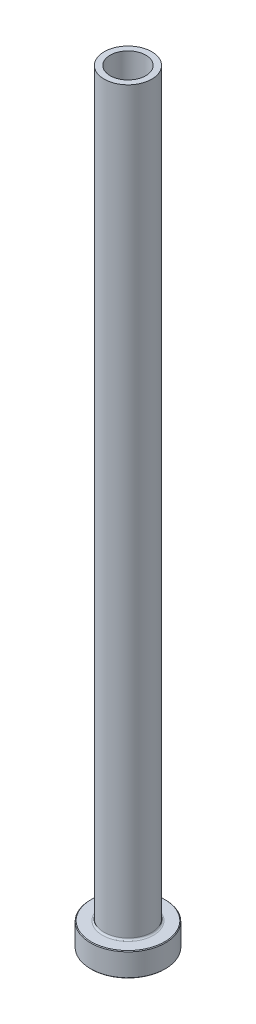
ISO-10303-21;
HEADER;
FILE_DESCRIPTION(('STEP AP214'),'2;1');
FILE_NAME('part.step','',(''),(''),'','','');
FILE_SCHEMA(('AUTOMOTIVE_DESIGN { 1 0 10303 214 1 1 1 1 }'));
ENDSEC;
DATA;
#1=APPLICATION_CONTEXT('core data for automotive mechanical design processes');
#2=APPLICATION_PROTOCOL_DEFINITION('international standard','automotive_design',2000,#1);
#3=PRODUCT_CONTEXT('',#1,'mechanical');
#4=PRODUCT('Part','Part','',(#3));
#5=PRODUCT_RELATED_PRODUCT_CATEGORY('part','',(#4));
#6=PRODUCT_DEFINITION_FORMATION('','',#4);
#7=PRODUCT_DEFINITION_CONTEXT('part definition',#1,'design');
#8=PRODUCT_DEFINITION('design','',#6,#7);
#9=PRODUCT_DEFINITION_SHAPE('','',#8);
#10=(LENGTH_UNIT() NAMED_UNIT(*) SI_UNIT(.MILLI.,.METRE.));
#11=(NAMED_UNIT(*) PLANE_ANGLE_UNIT() SI_UNIT($,.RADIAN.));
#12=(NAMED_UNIT(*) SI_UNIT($,.STERADIAN.) SOLID_ANGLE_UNIT());
#13=UNCERTAINTY_MEASURE_WITH_UNIT(LENGTH_MEASURE(1.E-05),#10,'distance_accuracy_value','');
#14=(GEOMETRIC_REPRESENTATION_CONTEXT(3) GLOBAL_UNCERTAINTY_ASSIGNED_CONTEXT((#13)) GLOBAL_UNIT_ASSIGNED_CONTEXT((#10,
#11,#12)) REPRESENTATION_CONTEXT('',''));
#15=CARTESIAN_POINT('',(0.,0.,0.));
#16=DIRECTION('',(0.,0.,1.));
#17=DIRECTION('',(1.,0.,0.));
#18=AXIS2_PLACEMENT_3D('',#15,#16,#17);
#19=CARTESIAN_POINT('',(0.,92.1876809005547,0.));
#20=DIRECTION('',(0.,1.,0.));
#21=DIRECTION('',(0.,0.,1.));
#22=AXIS2_PLACEMENT_3D('',#19,#20,#21);
#23=CYLINDRICAL_SURFACE('',#22,5.25000000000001);
#24=CARTESIAN_POINT('',(0.,225.,0.));
#25=DIRECTION('',(0.,1.,0.));
#26=DIRECTION('',(0.,0.,1.));
#27=AXIS2_PLACEMENT_3D('',#24,#25,#26);
#28=CIRCLE('',#27,5.25000000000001);
#29=CARTESIAN_POINT('',(0.,225.,5.25000000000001));
#30=VERTEX_POINT('',#29);
#31=EDGE_CURVE('E62',#30,#30,#28,.T.);
#32=ORIENTED_EDGE('',*,*,#31,.T.);
#33=EDGE_LOOP('',(#32));
#34=FACE_BOUND('',#33,.T.);
#35=CARTESIAN_POINT('',(0.,170.,0.));
#36=DIRECTION('',(0.,1.,0.));
#37=DIRECTION('',(0.,0.,1.));
#38=AXIS2_PLACEMENT_3D('',#35,#36,#37);
#39=CIRCLE('',#38,5.25000000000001);
#40=CARTESIAN_POINT('',(0.,170.,5.25000000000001));
#41=VERTEX_POINT('',#40);
#42=EDGE_CURVE('E71',#41,#41,#39,.T.);
#43=ORIENTED_EDGE('',*,*,#42,.F.);
#44=EDGE_LOOP('',(#43));
#45=FACE_BOUND('',#44,.T.);
#46=ADVANCED_FACE('F30',(#34,#45),#23,.F.);
#47=CARTESIAN_POINT('',(-5.25000000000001,225.,0.));
#48=DIRECTION('',(0.,1.,0.));
#49=DIRECTION('',(0.,0.,1.));
#50=AXIS2_PLACEMENT_3D('',#47,#48,#49);
#51=PLANE('',#50);
#52=CARTESIAN_POINT('',(0.,225.,0.));
#53=DIRECTION('',(0.,1.,0.));
#54=DIRECTION('',(0.,0.,1.));
#55=AXIS2_PLACEMENT_3D('',#52,#53,#54);
#56=CIRCLE('',#55,7.00000000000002);
#57=CARTESIAN_POINT('',(0.,225.,7.00000000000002));
#58=VERTEX_POINT('',#57);
#59=EDGE_CURVE('E65',#58,#58,#56,.T.);
#60=ORIENTED_EDGE('',*,*,#59,.T.);
#61=EDGE_LOOP('',(#60));
#62=FACE_BOUND('',#61,.T.);
#63=ORIENTED_EDGE('',*,*,#31,.F.);
#64=EDGE_LOOP('',(#63));
#65=FACE_BOUND('',#64,.T.);
#66=ADVANCED_FACE('F79',(#62,#65),#51,.T.);
#67=CARTESIAN_POINT('',(0.,92.1876809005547,0.));
#68=DIRECTION('',(0.,1.,0.));
#69=DIRECTION('',(0.,0.,1.));
#70=AXIS2_PLACEMENT_3D('',#67,#68,#69);
#71=CYLINDRICAL_SURFACE('',#70,7.);
#72=CARTESIAN_POINT('',(0.,7.50000000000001,0.));
#73=DIRECTION('',(0.,1.,0.));
#74=DIRECTION('',(0.,0.,1.));
#75=AXIS2_PLACEMENT_3D('',#72,#73,#74);
#76=CIRCLE('',#75,7.);
#77=CARTESIAN_POINT('',(0.,7.50000000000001,7.));
#78=VERTEX_POINT('',#77);
#79=EDGE_CURVE('E59',#78,#78,#76,.T.);
#80=ORIENTED_EDGE('',*,*,#79,.T.);
#81=EDGE_LOOP('',(#80));
#82=FACE_BOUND('',#81,.T.);
#83=ORIENTED_EDGE('',*,*,#59,.F.);
#84=EDGE_LOOP('',(#83));
#85=FACE_BOUND('',#84,.T.);
#86=ADVANCED_FACE('F85',(#82,#85),#71,.T.);
#87=CARTESIAN_POINT('',(-6.99999999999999,7.,0.));
#88=DIRECTION('',(0.,1.,0.));
#89=DIRECTION('',(0.,0.,1.));
#90=AXIS2_PLACEMENT_3D('',#87,#88,#89);
#91=PLANE('',#90);
#92=CARTESIAN_POINT('',(0.,7.,0.));
#93=DIRECTION('',(0.,1.,0.));
#94=DIRECTION('',(0.,0.,1.));
#95=AXIS2_PLACEMENT_3D('',#92,#93,#94);
#96=CIRCLE('',#95,10.8);
#97=CARTESIAN_POINT('',(0.,7.,10.8));
#98=VERTEX_POINT('',#97);
#99=EDGE_CURVE('E53',#98,#98,#96,.T.);
#100=ORIENTED_EDGE('',*,*,#99,.T.);
#101=EDGE_LOOP('',(#100));
#102=FACE_BOUND('',#101,.T.);
#103=CARTESIAN_POINT('',(0.,7.,0.));
#104=DIRECTION('',(0.,1.,0.));
#105=DIRECTION('',(0.,0.,1.));
#106=AXIS2_PLACEMENT_3D('',#103,#104,#105);
#107=CIRCLE('',#106,7.5);
#108=CARTESIAN_POINT('',(0.,7.,7.5));
#109=VERTEX_POINT('',#108);
#110=EDGE_CURVE('E56',#109,#109,#107,.F.);
#111=ORIENTED_EDGE('',*,*,#110,.T.);
#112=EDGE_LOOP('',(#111));
#113=FACE_BOUND('',#112,.T.);
#114=ADVANCED_FACE('F111',(#102,#113),#91,.T.);
#115=CARTESIAN_POINT('',(0.,92.1876809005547,0.));
#116=DIRECTION('',(0.,1.,0.));
#117=DIRECTION('',(0.,0.,1.));
#118=AXIS2_PLACEMENT_3D('',#115,#116,#117);
#119=CYLINDRICAL_SURFACE('',#118,11.);
#120=CARTESIAN_POINT('',(0.,6.79999999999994,0.));
#121=DIRECTION('',(0.,1.,0.));
#122=DIRECTION('',(0.,0.,1.));
#123=AXIS2_PLACEMENT_3D('',#120,#121,#122);
#124=CIRCLE('',#123,11.);
#125=CARTESIAN_POINT('',(0.,6.79999999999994,11.));
#126=VERTEX_POINT('',#125);
#127=EDGE_CURVE('E45',#126,#126,#124,.F.);
#128=ORIENTED_EDGE('',*,*,#127,.T.);
#129=EDGE_LOOP('',(#128));
#130=FACE_BOUND('',#129,.T.);
#131=CARTESIAN_POINT('',(0.,0.19999999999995,0.));
#132=DIRECTION('',(0.,-1.,0.));
#133=DIRECTION('',(0.,0.,-1.));
#134=AXIS2_PLACEMENT_3D('',#131,#132,#133);
#135=CIRCLE('',#134,11.);
#136=CARTESIAN_POINT('',(0.,0.19999999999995,11.));
#137=VERTEX_POINT('',#136);
#138=EDGE_CURVE('E50',#137,#137,#135,.F.);
#139=ORIENTED_EDGE('',*,*,#138,.T.);
#140=EDGE_LOOP('',(#139));
#141=FACE_BOUND('',#140,.T.);
#142=ADVANCED_FACE('F108',(#130,#141),#119,.T.);
#143=CARTESIAN_POINT('',(-11.,0.,0.));
#144=DIRECTION('',(0.,-1.,0.));
#145=DIRECTION('',(0.,0.,-1.));
#146=AXIS2_PLACEMENT_3D('',#143,#144,#145);
#147=PLANE('',#146);
#148=CARTESIAN_POINT('',(0.,0.,0.));
#149=DIRECTION('',(0.,-1.,0.));
#150=DIRECTION('',(0.,0.,-1.));
#151=AXIS2_PLACEMENT_3D('',#148,#149,#150);
#152=CIRCLE('',#151,6.00000000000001);
#153=CARTESIAN_POINT('',(0.,0.,-6.00000000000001));
#154=VERTEX_POINT('',#153);
#155=EDGE_CURVE('E37',#154,#154,#152,.F.);
#156=ORIENTED_EDGE('',*,*,#155,.T.);
#157=EDGE_LOOP('',(#156));
#158=FACE_BOUND('',#157,.T.);
#159=CARTESIAN_POINT('',(0.,0.,0.));
#160=DIRECTION('',(0.,-1.,0.));
#161=DIRECTION('',(0.,0.,-1.));
#162=AXIS2_PLACEMENT_3D('',#159,#160,#161);
#163=CIRCLE('',#162,10.8);
#164=CARTESIAN_POINT('',(0.,0.,10.8));
#165=VERTEX_POINT('',#164);
#166=EDGE_CURVE('E41',#165,#165,#163,.T.);
#167=ORIENTED_EDGE('',*,*,#166,.T.);
#168=EDGE_LOOP('',(#167));
#169=FACE_BOUND('',#168,.T.);
#170=ADVANCED_FACE('F110',(#158,#169),#147,.T.);
#171=CARTESIAN_POINT('',(0.,92.1876809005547,0.));
#172=DIRECTION('',(0.,1.,0.));
#173=DIRECTION('',(0.,0.,1.));
#174=AXIS2_PLACEMENT_3D('',#171,#172,#173);
#175=CYLINDRICAL_SURFACE('',#174,5.5);
#176=CARTESIAN_POINT('',(0.,0.500000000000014,0.));
#177=DIRECTION('',(0.,-1.,0.));
#178=DIRECTION('',(0.,0.,-1.));
#179=AXIS2_PLACEMENT_3D('',#176,#177,#178);
#180=CIRCLE('',#179,5.5);
#181=CARTESIAN_POINT('',(0.,0.500000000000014,-5.5));
#182=VERTEX_POINT('',#181);
#183=EDGE_CURVE('E10',#182,#182,#180,.T.);
#184=ORIENTED_EDGE('',*,*,#183,.T.);
#185=EDGE_LOOP('',(#184));
#186=FACE_BOUND('',#185,.T.);
#187=CARTESIAN_POINT('',(0.,158.,0.));
#188=DIRECTION('',(0.,1.,0.));
#189=DIRECTION('',(0.,0.,1.));
#190=AXIS2_PLACEMENT_3D('',#187,#188,#189);
#191=CIRCLE('',#190,5.50000000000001);
#192=CARTESIAN_POINT('',(0.,158.,5.50000000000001));
#193=VERTEX_POINT('',#192);
#194=EDGE_CURVE('E68',#193,#193,#191,.T.);
#195=ORIENTED_EDGE('',*,*,#194,.T.);
#196=EDGE_LOOP('',(#195));
#197=FACE_BOUND('',#196,.T.);
#198=ADVANCED_FACE('F118',(#186,#197),#175,.F.);
#199=CARTESIAN_POINT('',(0.,158.,0.));
#200=DIRECTION('',(0.,-1.,0.));
#201=DIRECTION('',(0.,0.,-1.));
#202=AXIS2_PLACEMENT_3D('',#199,#200,#201);
#203=CONICAL_SURFACE('',#202,5.50000000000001,0.0208303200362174);
#204=ORIENTED_EDGE('',*,*,#42,.T.);
#205=EDGE_LOOP('',(#204));
#206=FACE_BOUND('',#205,.T.);
#207=ORIENTED_EDGE('',*,*,#194,.F.);
#208=EDGE_LOOP('',(#207));
#209=FACE_BOUND('',#208,.T.);
#210=ADVANCED_FACE('F75',(#206,#209),#203,.F.);
#211=CARTESIAN_POINT('',(0.,7.50000000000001,0.));
#212=DIRECTION('',(0.,1.,0.));
#213=DIRECTION('',(0.,0.,1.));
#214=AXIS2_PLACEMENT_3D('',#211,#212,#213);
#215=TOROIDAL_SURFACE('',#214,7.5,0.5);
#216=ORIENTED_EDGE('',*,*,#110,.F.);
#217=EDGE_LOOP('',(#216));
#218=FACE_BOUND('',#217,.T.);
#219=ORIENTED_EDGE('',*,*,#79,.F.);
#220=EDGE_LOOP('',(#219));
#221=FACE_BOUND('',#220,.T.);
#222=ADVANCED_FACE('F90',(#218,#221),#215,.F.);
#223=CARTESIAN_POINT('',(0.,7.00000000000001,0.));
#224=DIRECTION('',(0.,-1.,0.));
#225=DIRECTION('',(0.,0.,-1.));
#226=AXIS2_PLACEMENT_3D('',#223,#224,#225);
#227=CONICAL_SURFACE('',#226,10.7999999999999,0.785398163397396);
#228=ORIENTED_EDGE('',*,*,#127,.F.);
#229=EDGE_LOOP('',(#228));
#230=FACE_BOUND('',#229,.T.);
#231=ORIENTED_EDGE('',*,*,#99,.F.);
#232=EDGE_LOOP('',(#231));
#233=FACE_BOUND('',#232,.T.);
#234=ADVANCED_FACE('F93',(#230,#233),#227,.T.);
#235=CARTESIAN_POINT('',(0.,0.19999999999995,0.));
#236=DIRECTION('',(0.,1.,0.));
#237=DIRECTION('',(0.,0.,1.));
#238=AXIS2_PLACEMENT_3D('',#235,#236,#237);
#239=CONICAL_SURFACE('',#238,11.,0.785398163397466);
#240=CARTESIAN_POINT('',(0.,0.,10.8));
#241=CARTESIAN_POINT('',(0.,0.00208333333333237,10.8020833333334));
#242=CARTESIAN_POINT('',(0.,0.00416666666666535,10.8041666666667));
#243=CARTESIAN_POINT('',(0.,0.0083333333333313,10.8083333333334));
#244=CARTESIAN_POINT('',(0.,0.0104166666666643,10.8104166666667));
#245=CARTESIAN_POINT('',(0.,0.0145833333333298,10.8145833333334));
#246=CARTESIAN_POINT('',(0.,0.0166666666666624,10.8166666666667));
#247=CARTESIAN_POINT('',(0.,0.020833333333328,10.8208333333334));
#248=CARTESIAN_POINT('',(0.,0.0229166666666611,10.8229166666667));
#249=CARTESIAN_POINT('',(0.,0.0270833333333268,10.8270833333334));
#250=CARTESIAN_POINT('',(0.,0.0291666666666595,10.8291666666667));
#251=CARTESIAN_POINT('',(0.,0.033333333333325,10.8333333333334));
#252=CARTESIAN_POINT('',(0.,0.0354166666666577,10.8354166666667));
#253=CARTESIAN_POINT('',(0.,0.0395833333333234,10.8395833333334));
#254=CARTESIAN_POINT('',(0.,0.0416666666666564,10.8416666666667));
#255=CARTESIAN_POINT('',(0.,0.0458333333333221,10.8458333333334));
#256=CARTESIAN_POINT('',(0.,0.0479166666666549,10.8479166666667));
#257=CARTESIAN_POINT('',(0.,0.0520833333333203,10.8520833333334));
#258=CARTESIAN_POINT('',(0.,0.054166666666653,10.8541666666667));
#259=CARTESIAN_POINT('',(0.,0.0583333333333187,10.8583333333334));
#260=CARTESIAN_POINT('',(0.,0.0604166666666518,10.8604166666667));
#261=CARTESIAN_POINT('',(0.,0.0645833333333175,10.8645833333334));
#262=CARTESIAN_POINT('',(0.,0.0666666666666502,10.8666666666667));
#263=CARTESIAN_POINT('',(0.,0.0708333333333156,10.8708333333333));
#264=CARTESIAN_POINT('',(0.,0.0729166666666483,10.8729166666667));
#265=CARTESIAN_POINT('',(0.,0.0770833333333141,10.8770833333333));
#266=CARTESIAN_POINT('',(0.,0.0791666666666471,10.8791666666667));
#267=CARTESIAN_POINT('',(0.,0.0833333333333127,10.8833333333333));
#268=CARTESIAN_POINT('',(0.,0.0854166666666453,10.8854166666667));
#269=CARTESIAN_POINT('',(0.,0.0895833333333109,10.8895833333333));
#270=CARTESIAN_POINT('',(0.,0.0916666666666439,10.8916666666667));
#271=CARTESIAN_POINT('',(0.,0.0958333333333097,10.8958333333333));
#272=CARTESIAN_POINT('',(0.,0.0979166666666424,10.8979166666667));
#273=CARTESIAN_POINT('',(0.,0.102083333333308,10.9020833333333));
#274=CARTESIAN_POINT('',(0.,0.104166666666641,10.9041666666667));
#275=CARTESIAN_POINT('',(0.,0.108333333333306,10.9083333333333));
#276=CARTESIAN_POINT('',(0.,0.110416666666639,10.9104166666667));
#277=CARTESIAN_POINT('',(0.,0.114583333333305,10.9145833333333));
#278=CARTESIAN_POINT('',(0.,0.116666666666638,10.9166666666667));
#279=CARTESIAN_POINT('',(0.,0.120833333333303,10.9208333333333));
#280=CARTESIAN_POINT('',(0.,0.122916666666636,10.9229166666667));
#281=CARTESIAN_POINT('',(0.,0.127083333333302,10.9270833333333));
#282=CARTESIAN_POINT('',(0.,0.129166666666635,10.9291666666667));
#283=CARTESIAN_POINT('',(0.,0.1333333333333,10.9333333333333));
#284=CARTESIAN_POINT('',(0.,0.135416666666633,10.9354166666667));
#285=CARTESIAN_POINT('',(0.,0.139583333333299,10.9395833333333));
#286=CARTESIAN_POINT('',(0.,0.141666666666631,10.9416666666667));
#287=CARTESIAN_POINT('',(0.,0.145833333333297,10.9458333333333));
#288=CARTESIAN_POINT('',(0.,0.14791666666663,10.9479166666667));
#289=CARTESIAN_POINT('',(0.,0.152083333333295,10.9520833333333));
#290=CARTESIAN_POINT('',(0.,0.154166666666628,10.9541666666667));
#291=CARTESIAN_POINT('',(0.,0.158333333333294,10.9583333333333));
#292=CARTESIAN_POINT('',(0.,0.160416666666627,10.9604166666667));
#293=CARTESIAN_POINT('',(0.,0.164583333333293,10.9645833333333));
#294=CARTESIAN_POINT('',(0.,0.166666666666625,10.9666666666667));
#295=CARTESIAN_POINT('',(0.,0.170833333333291,10.9708333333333));
#296=CARTESIAN_POINT('',(0.,0.172916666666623,10.9729166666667));
#297=CARTESIAN_POINT('',(0.,0.177083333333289,10.9770833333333));
#298=CARTESIAN_POINT('',(0.,0.179166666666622,10.9791666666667));
#299=CARTESIAN_POINT('',(0.,0.183333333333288,10.9833333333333));
#300=CARTESIAN_POINT('',(0.,0.18541666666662,10.9854166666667));
#301=CARTESIAN_POINT('',(0.,0.189583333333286,10.9895833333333));
#302=CARTESIAN_POINT('',(0.,0.191666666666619,10.9916666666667));
#303=CARTESIAN_POINT('',(0.,0.195833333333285,10.9958333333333));
#304=CARTESIAN_POINT('',(0.,0.197916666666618,10.9979166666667));
#305=CARTESIAN_POINT('',(0.,0.19999999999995,11.));
#306=B_SPLINE_CURVE_WITH_KNOTS('',3,(#240,#241,#242,#243,#244,#245,#246,#247,#248,#249,#250,
#251,#252,#253,#254,#255,#256,#257,#258,#259,#260,#261,#262,#263,#264,#265,#266,#267,#268,#269,
#270,#271,#272,#273,#274,#275,#276,#277,#278,#279,#280,#281,#282,#283,#284,#285,#286,#287,#288,
#289,#290,#291,#292,#293,#294,#295,#296,#297,#298,#299,#300,#301,#302,#303,#304,#305),
.UNSPECIFIED.,.F.,.F.,(4,2,2,2,2,2,2,2,2,2,2,2,2,2,2,2,2,2,2,2,2,2,2,2,2,2,2,2,2,2,2,2,4),(0.,
0.00883883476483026,0.0176776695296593,0.0265165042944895,0.0353553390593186,0.0441941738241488,
0.0530330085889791,0.0618718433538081,0.0707106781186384,0.0795495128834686,0.0883883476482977,
0.0972271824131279,0.106066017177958,0.114904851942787,0.123743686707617,0.132582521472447,
0.141421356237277,0.150260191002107,0.159099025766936,0.167937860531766,0.176776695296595,
0.185615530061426,0.194454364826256,0.203293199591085,0.212132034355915,0.220970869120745,
0.229809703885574,0.238648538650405,0.247487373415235,0.256326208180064,0.265165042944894,
0.274003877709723,0.282842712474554),.UNSPECIFIED.);
#307=EDGE_CURVE('BSEAM96',#165,#137,#306,.T.);
#308=ORIENTED_EDGE('',*,*,#166,.F.);
#309=ORIENTED_EDGE('',*,*,#138,.F.);
#310=ORIENTED_EDGE('',*,*,#307,.T.);
#311=ORIENTED_EDGE('',*,*,#307,.F.);
#312=EDGE_LOOP('',(#308,#310,#309,#311));
#313=FACE_BOUND('',#312,.T.);
#314=ADVANCED_FACE('F96',(#313),#239,.T.);
#315=CARTESIAN_POINT('',(0.,0.,0.));
#316=DIRECTION('',(0.,-1.,0.));
#317=DIRECTION('',(0.,0.,-1.));
#318=AXIS2_PLACEMENT_3D('',#315,#316,#317);
#319=CONICAL_SURFACE('',#318,6.00000000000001,0.785398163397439);
#320=ORIENTED_EDGE('',*,*,#183,.F.);
#321=EDGE_LOOP('',(#320));
#322=FACE_BOUND('',#321,.T.);
#323=ORIENTED_EDGE('',*,*,#155,.F.);
#324=EDGE_LOOP('',(#323));
#325=FACE_BOUND('',#324,.T.);
#326=ADVANCED_FACE('F32',(#322,#325),#319,.F.);
#327=CLOSED_SHELL('',(#46,#66,#86,#114,#142,#170,#198,#210,#222,#234,#314,#326));
#328=MANIFOLD_SOLID_BREP('B2',#327);
#329=ADVANCED_BREP_SHAPE_REPRESENTATION('',(#18,#328),#14);
#330=SHAPE_DEFINITION_REPRESENTATION(#9,#329);
ENDSEC;
END-ISO-10303-21;
